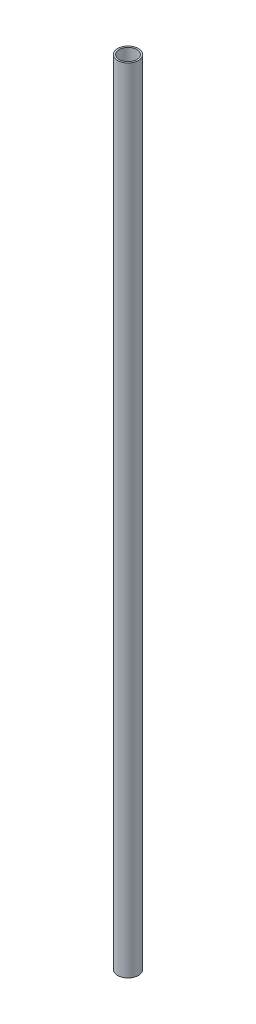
ISO-10303-21;
HEADER;
FILE_DESCRIPTION(('STEP AP214'),'2;1');
FILE_NAME('part.step','',(''),(''),'','','');
FILE_SCHEMA(('AUTOMOTIVE_DESIGN { 1 0 10303 214 1 1 1 1 }'));
ENDSEC;
DATA;
#1=APPLICATION_CONTEXT('core data for automotive mechanical design processes');
#2=APPLICATION_PROTOCOL_DEFINITION('international standard','automotive_design',2000,#1);
#3=PRODUCT_CONTEXT('',#1,'mechanical');
#4=PRODUCT('Part','Part','',(#3));
#5=PRODUCT_RELATED_PRODUCT_CATEGORY('part','',(#4));
#6=PRODUCT_DEFINITION_FORMATION('','',#4);
#7=PRODUCT_DEFINITION_CONTEXT('part definition',#1,'design');
#8=PRODUCT_DEFINITION('design','',#6,#7);
#9=PRODUCT_DEFINITION_SHAPE('','',#8);
#10=(LENGTH_UNIT() NAMED_UNIT(*) SI_UNIT(.MILLI.,.METRE.));
#11=(NAMED_UNIT(*) PLANE_ANGLE_UNIT() SI_UNIT($,.RADIAN.));
#12=(NAMED_UNIT(*) SI_UNIT($,.STERADIAN.) SOLID_ANGLE_UNIT());
#13=UNCERTAINTY_MEASURE_WITH_UNIT(LENGTH_MEASURE(1.E-05),#10,'distance_accuracy_value','');
#14=(GEOMETRIC_REPRESENTATION_CONTEXT(3) GLOBAL_UNCERTAINTY_ASSIGNED_CONTEXT((#13)) GLOBAL_UNIT_ASSIGNED_CONTEXT((#10,
#11,#12)) REPRESENTATION_CONTEXT('',''));
#15=CARTESIAN_POINT('',(0.,0.,0.));
#16=DIRECTION('',(0.,0.,1.));
#17=DIRECTION('',(1.,0.,0.));
#18=AXIS2_PLACEMENT_3D('',#15,#16,#17);
#19=CARTESIAN_POINT('',(0.,950.,0.));
#20=DIRECTION('',(0.,1.,0.));
#21=DIRECTION('',(0.,0.,1.));
#22=AXIS2_PLACEMENT_3D('',#19,#20,#21);
#23=PLANE('',#22);
#24=CARTESIAN_POINT('',(0.,950.,0.));
#25=DIRECTION('',(0.,1.,0.));
#26=DIRECTION('',(0.,0.,1.));
#27=AXIS2_PLACEMENT_3D('',#24,#25,#26);
#28=CIRCLE('',#27,12.5);
#29=CARTESIAN_POINT('',(0.,950.,-12.5));
#30=VERTEX_POINT('',#29);
#31=EDGE_CURVE('E10',#30,#30,#28,.T.);
#32=ORIENTED_EDGE('',*,*,#31,.T.);
#33=EDGE_LOOP('',(#32));
#34=FACE_BOUND('',#33,.T.);
#35=CARTESIAN_POINT('',(0.,950.,0.));
#36=DIRECTION('',(0.,1.,0.));
#37=DIRECTION('',(0.,0.,1.));
#38=AXIS2_PLACEMENT_3D('',#35,#36,#37);
#39=CIRCLE('',#38,10.5);
#40=CARTESIAN_POINT('',(0.,950.,-10.5));
#41=VERTEX_POINT('',#40);
#42=EDGE_CURVE('E51',#41,#41,#39,.T.);
#43=ORIENTED_EDGE('',*,*,#42,.F.);
#44=EDGE_LOOP('',(#43));
#45=FACE_BOUND('',#44,.T.);
#46=ADVANCED_FACE('F40',(#34,#45),#23,.T.);
#47=CARTESIAN_POINT('',(0.,0.,0.));
#48=DIRECTION('',(0.,1.,0.));
#49=DIRECTION('',(0.,0.,1.));
#50=AXIS2_PLACEMENT_3D('',#47,#48,#49);
#51=PLANE('',#50);
#52=CARTESIAN_POINT('',(0.,0.,0.));
#53=DIRECTION('',(0.,1.,0.));
#54=DIRECTION('',(0.,0.,1.));
#55=AXIS2_PLACEMENT_3D('',#52,#53,#54);
#56=CIRCLE('',#55,12.5);
#57=CARTESIAN_POINT('',(0.,-1.11022302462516E-13,-12.5));
#58=VERTEX_POINT('',#57);
#59=EDGE_CURVE('E44',#58,#58,#56,.T.);
#60=ORIENTED_EDGE('',*,*,#59,.F.);
#61=EDGE_LOOP('',(#60));
#62=FACE_BOUND('',#61,.T.);
#63=CARTESIAN_POINT('',(0.,0.,0.));
#64=DIRECTION('',(0.,1.,0.));
#65=DIRECTION('',(0.,0.,1.));
#66=AXIS2_PLACEMENT_3D('',#63,#64,#65);
#67=CIRCLE('',#66,10.5);
#68=CARTESIAN_POINT('',(0.,-1.11022302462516E-13,-10.5));
#69=VERTEX_POINT('',#68);
#70=EDGE_CURVE('E53',#69,#69,#67,.T.);
#71=ORIENTED_EDGE('',*,*,#70,.T.);
#72=EDGE_LOOP('',(#71));
#73=FACE_BOUND('',#72,.T.);
#74=ADVANCED_FACE('F63',(#62,#73),#51,.F.);
#75=CARTESIAN_POINT('',(0.,950.,0.));
#76=DIRECTION('',(0.,-1.,0.));
#77=DIRECTION('',(0.,0.,-1.));
#78=AXIS2_PLACEMENT_3D('',#75,#76,#77);
#79=CYLINDRICAL_SURFACE('',#78,12.5);
#80=CARTESIAN_POINT('',(0.,950.,-12.5));
#81=CARTESIAN_POINT('',(0.,940.104166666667,-12.5));
#82=CARTESIAN_POINT('',(0.,930.208333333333,-12.5));
#83=CARTESIAN_POINT('',(0.,910.416666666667,-12.5));
#84=CARTESIAN_POINT('',(0.,900.520833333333,-12.5));
#85=CARTESIAN_POINT('',(0.,880.729166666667,-12.5));
#86=CARTESIAN_POINT('',(0.,870.833333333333,-12.5));
#87=CARTESIAN_POINT('',(0.,851.041666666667,-12.5));
#88=CARTESIAN_POINT('',(0.,841.145833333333,-12.5));
#89=CARTESIAN_POINT('',(0.,821.354166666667,-12.5));
#90=CARTESIAN_POINT('',(0.,811.458333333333,-12.5));
#91=CARTESIAN_POINT('',(0.,791.666666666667,-12.5));
#92=CARTESIAN_POINT('',(0.,781.770833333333,-12.5));
#93=CARTESIAN_POINT('',(0.,761.979166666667,-12.5));
#94=CARTESIAN_POINT('',(0.,752.083333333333,-12.5));
#95=CARTESIAN_POINT('',(0.,732.291666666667,-12.5));
#96=CARTESIAN_POINT('',(0.,722.395833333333,-12.5));
#97=CARTESIAN_POINT('',(0.,702.604166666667,-12.5));
#98=CARTESIAN_POINT('',(0.,692.708333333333,-12.5));
#99=CARTESIAN_POINT('',(0.,672.916666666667,-12.5));
#100=CARTESIAN_POINT('',(0.,663.020833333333,-12.5));
#101=CARTESIAN_POINT('',(0.,643.229166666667,-12.5));
#102=CARTESIAN_POINT('',(0.,633.333333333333,-12.5));
#103=CARTESIAN_POINT('',(0.,613.541666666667,-12.5));
#104=CARTESIAN_POINT('',(0.,603.645833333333,-12.5));
#105=CARTESIAN_POINT('',(0.,583.854166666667,-12.5));
#106=CARTESIAN_POINT('',(0.,573.958333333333,-12.5));
#107=CARTESIAN_POINT('',(0.,554.166666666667,-12.5));
#108=CARTESIAN_POINT('',(0.,544.270833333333,-12.5));
#109=CARTESIAN_POINT('',(0.,524.479166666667,-12.5));
#110=CARTESIAN_POINT('',(0.,514.583333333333,-12.5));
#111=CARTESIAN_POINT('',(0.,494.791666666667,-12.5));
#112=CARTESIAN_POINT('',(0.,484.895833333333,-12.5));
#113=CARTESIAN_POINT('',(0.,465.104166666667,-12.5));
#114=CARTESIAN_POINT('',(0.,455.208333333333,-12.5));
#115=CARTESIAN_POINT('',(0.,435.416666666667,-12.5));
#116=CARTESIAN_POINT('',(0.,425.520833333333,-12.5));
#117=CARTESIAN_POINT('',(0.,405.729166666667,-12.5));
#118=CARTESIAN_POINT('',(0.,395.833333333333,-12.5));
#119=CARTESIAN_POINT('',(0.,376.041666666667,-12.5));
#120=CARTESIAN_POINT('',(0.,366.145833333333,-12.5));
#121=CARTESIAN_POINT('',(0.,346.354166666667,-12.5));
#122=CARTESIAN_POINT('',(0.,336.458333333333,-12.5));
#123=CARTESIAN_POINT('',(0.,316.666666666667,-12.5));
#124=CARTESIAN_POINT('',(0.,306.770833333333,-12.5));
#125=CARTESIAN_POINT('',(0.,286.979166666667,-12.5));
#126=CARTESIAN_POINT('',(0.,277.083333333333,-12.5));
#127=CARTESIAN_POINT('',(0.,257.291666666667,-12.5));
#128=CARTESIAN_POINT('',(0.,247.395833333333,-12.5));
#129=CARTESIAN_POINT('',(0.,227.604166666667,-12.5));
#130=CARTESIAN_POINT('',(0.,217.708333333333,-12.5));
#131=CARTESIAN_POINT('',(0.,197.916666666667,-12.5));
#132=CARTESIAN_POINT('',(0.,188.020833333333,-12.5));
#133=CARTESIAN_POINT('',(0.,168.229166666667,-12.5));
#134=CARTESIAN_POINT('',(0.,158.333333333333,-12.5));
#135=CARTESIAN_POINT('',(0.,138.541666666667,-12.5));
#136=CARTESIAN_POINT('',(0.,128.645833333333,-12.5));
#137=CARTESIAN_POINT('',(0.,108.854166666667,-12.5));
#138=CARTESIAN_POINT('',(0.,98.9583333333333,-12.5));
#139=CARTESIAN_POINT('',(0.,79.1666666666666,-12.5));
#140=CARTESIAN_POINT('',(0.,69.2708333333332,-12.5));
#141=CARTESIAN_POINT('',(0.,49.4791666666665,-12.5));
#142=CARTESIAN_POINT('',(0.,39.5833333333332,-12.5));
#143=CARTESIAN_POINT('',(0.,19.7916666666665,-12.5));
#144=CARTESIAN_POINT('',(0.,9.89583333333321,-12.5));
#145=CARTESIAN_POINT('',(0.,-1.11022302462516E-13,-12.5));
#146=B_SPLINE_CURVE_WITH_KNOTS('',3,(#80,#81,#82,#83,#84,#85,#86,#87,#88,#89,#90,#91,#92,#93,
#94,#95,#96,#97,#98,#99,#100,#101,#102,#103,#104,#105,#106,#107,#108,#109,#110,#111,#112,#113,
#114,#115,#116,#117,#118,#119,#120,#121,#122,#123,#124,#125,#126,#127,#128,#129,#130,#131,#132,
#133,#134,#135,#136,#137,#138,#139,#140,#141,#142,#143,#144,#145),.UNSPECIFIED.,.F.,.F.,(4,2,2,
2,2,2,2,2,2,2,2,2,2,2,2,2,2,2,2,2,2,2,2,2,2,2,2,2,2,2,2,2,4),(0.,29.6875000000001,
59.3750000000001,89.0625,118.75,148.4375,178.125,207.8125,237.5,267.1875,296.875,326.5625,
356.25,385.9375,415.625,445.3125,475.,504.6875,534.375,564.0625,593.75,623.4375,653.125,
682.8125,712.5,742.1875,771.875,801.5625,831.25,860.9375,890.625,920.3125,950.),.UNSPECIFIED.);
#147=EDGE_CURVE('BSEAM42',#30,#58,#146,.T.);
#148=ORIENTED_EDGE('',*,*,#31,.F.);
#149=ORIENTED_EDGE('',*,*,#59,.T.);
#150=ORIENTED_EDGE('',*,*,#147,.T.);
#151=ORIENTED_EDGE('',*,*,#147,.F.);
#152=EDGE_LOOP('',(#148,#150,#149,#151));
#153=FACE_BOUND('',#152,.T.);
#154=ADVANCED_FACE('F42',(#153),#79,.T.);
#155=CARTESIAN_POINT('',(0.,950.,0.));
#156=DIRECTION('',(0.,-1.,0.));
#157=DIRECTION('',(0.,0.,-1.));
#158=AXIS2_PLACEMENT_3D('',#155,#156,#157);
#159=CYLINDRICAL_SURFACE('',#158,10.5);
#160=CARTESIAN_POINT('',(0.,950.,-10.5));
#161=CARTESIAN_POINT('',(0.,940.104166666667,-10.5));
#162=CARTESIAN_POINT('',(0.,930.208333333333,-10.5));
#163=CARTESIAN_POINT('',(0.,910.416666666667,-10.5));
#164=CARTESIAN_POINT('',(0.,900.520833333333,-10.5));
#165=CARTESIAN_POINT('',(0.,880.729166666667,-10.5));
#166=CARTESIAN_POINT('',(0.,870.833333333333,-10.5));
#167=CARTESIAN_POINT('',(0.,851.041666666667,-10.5));
#168=CARTESIAN_POINT('',(0.,841.145833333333,-10.5));
#169=CARTESIAN_POINT('',(0.,821.354166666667,-10.5));
#170=CARTESIAN_POINT('',(0.,811.458333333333,-10.5));
#171=CARTESIAN_POINT('',(0.,791.666666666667,-10.5));
#172=CARTESIAN_POINT('',(0.,781.770833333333,-10.5));
#173=CARTESIAN_POINT('',(0.,761.979166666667,-10.5));
#174=CARTESIAN_POINT('',(0.,752.083333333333,-10.5));
#175=CARTESIAN_POINT('',(0.,732.291666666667,-10.5));
#176=CARTESIAN_POINT('',(0.,722.395833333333,-10.5));
#177=CARTESIAN_POINT('',(0.,702.604166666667,-10.5));
#178=CARTESIAN_POINT('',(0.,692.708333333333,-10.5));
#179=CARTESIAN_POINT('',(0.,672.916666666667,-10.5));
#180=CARTESIAN_POINT('',(0.,663.020833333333,-10.5));
#181=CARTESIAN_POINT('',(0.,643.229166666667,-10.5));
#182=CARTESIAN_POINT('',(0.,633.333333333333,-10.5));
#183=CARTESIAN_POINT('',(0.,613.541666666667,-10.5));
#184=CARTESIAN_POINT('',(0.,603.645833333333,-10.5));
#185=CARTESIAN_POINT('',(0.,583.854166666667,-10.5));
#186=CARTESIAN_POINT('',(0.,573.958333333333,-10.5));
#187=CARTESIAN_POINT('',(0.,554.166666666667,-10.5));
#188=CARTESIAN_POINT('',(0.,544.270833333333,-10.5));
#189=CARTESIAN_POINT('',(0.,524.479166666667,-10.5));
#190=CARTESIAN_POINT('',(0.,514.583333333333,-10.5));
#191=CARTESIAN_POINT('',(0.,494.791666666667,-10.5));
#192=CARTESIAN_POINT('',(0.,484.895833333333,-10.5));
#193=CARTESIAN_POINT('',(0.,465.104166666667,-10.5));
#194=CARTESIAN_POINT('',(0.,455.208333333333,-10.5));
#195=CARTESIAN_POINT('',(0.,435.416666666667,-10.5));
#196=CARTESIAN_POINT('',(0.,425.520833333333,-10.5));
#197=CARTESIAN_POINT('',(0.,405.729166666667,-10.5));
#198=CARTESIAN_POINT('',(0.,395.833333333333,-10.5));
#199=CARTESIAN_POINT('',(0.,376.041666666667,-10.5));
#200=CARTESIAN_POINT('',(0.,366.145833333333,-10.5));
#201=CARTESIAN_POINT('',(0.,346.354166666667,-10.5));
#202=CARTESIAN_POINT('',(0.,336.458333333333,-10.5));
#203=CARTESIAN_POINT('',(0.,316.666666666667,-10.5));
#204=CARTESIAN_POINT('',(0.,306.770833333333,-10.5));
#205=CARTESIAN_POINT('',(0.,286.979166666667,-10.5));
#206=CARTESIAN_POINT('',(0.,277.083333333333,-10.5));
#207=CARTESIAN_POINT('',(0.,257.291666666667,-10.5));
#208=CARTESIAN_POINT('',(0.,247.395833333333,-10.5));
#209=CARTESIAN_POINT('',(0.,227.604166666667,-10.5));
#210=CARTESIAN_POINT('',(0.,217.708333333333,-10.5));
#211=CARTESIAN_POINT('',(0.,197.916666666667,-10.5));
#212=CARTESIAN_POINT('',(0.,188.020833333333,-10.5));
#213=CARTESIAN_POINT('',(0.,168.229166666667,-10.5));
#214=CARTESIAN_POINT('',(0.,158.333333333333,-10.5));
#215=CARTESIAN_POINT('',(0.,138.541666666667,-10.5));
#216=CARTESIAN_POINT('',(0.,128.645833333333,-10.5));
#217=CARTESIAN_POINT('',(0.,108.854166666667,-10.5));
#218=CARTESIAN_POINT('',(0.,98.9583333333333,-10.5));
#219=CARTESIAN_POINT('',(0.,79.1666666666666,-10.5));
#220=CARTESIAN_POINT('',(0.,69.2708333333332,-10.5));
#221=CARTESIAN_POINT('',(0.,49.4791666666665,-10.5));
#222=CARTESIAN_POINT('',(0.,39.5833333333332,-10.5));
#223=CARTESIAN_POINT('',(0.,19.7916666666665,-10.5));
#224=CARTESIAN_POINT('',(0.,9.89583333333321,-10.5));
#225=CARTESIAN_POINT('',(0.,-1.11022302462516E-13,-10.5));
#226=B_SPLINE_CURVE_WITH_KNOTS('',3,(#160,#161,#162,#163,#164,#165,#166,#167,#168,#169,#170,
#171,#172,#173,#174,#175,#176,#177,#178,#179,#180,#181,#182,#183,#184,#185,#186,#187,#188,#189,
#190,#191,#192,#193,#194,#195,#196,#197,#198,#199,#200,#201,#202,#203,#204,#205,#206,#207,#208,
#209,#210,#211,#212,#213,#214,#215,#216,#217,#218,#219,#220,#221,#222,#223,#224,#225),
.UNSPECIFIED.,.F.,.F.,(4,2,2,2,2,2,2,2,2,2,2,2,2,2,2,2,2,2,2,2,2,2,2,2,2,2,2,2,2,2,2,2,4),(0.,
29.6875,59.375,89.0624999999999,118.75,148.4375,178.125,207.8125,237.5,267.1875,296.875,
326.5625,356.25,385.9375,415.625,445.3125,475.,504.6875,534.375,564.0625,593.75,623.4375,
653.125,682.8125,712.5,742.1875,771.875,801.5625,831.25,860.9375,890.625,920.3125,950.),.UNSPECIFIED.);
#227=EDGE_CURVE('BSEAM59',#41,#69,#226,.T.);
#228=ORIENTED_EDGE('',*,*,#42,.T.);
#229=ORIENTED_EDGE('',*,*,#70,.F.);
#230=ORIENTED_EDGE('',*,*,#227,.T.);
#231=ORIENTED_EDGE('',*,*,#227,.F.);
#232=EDGE_LOOP('',(#228,#230,#229,#231));
#233=FACE_BOUND('',#232,.T.);
#234=ADVANCED_FACE('F59',(#233),#159,.F.);
#235=CLOSED_SHELL('',(#46,#74,#154,#234));
#236=MANIFOLD_SOLID_BREP('B2',#235);
#237=ADVANCED_BREP_SHAPE_REPRESENTATION('',(#18,#236),#14);
#238=SHAPE_DEFINITION_REPRESENTATION(#9,#237);
ENDSEC;
END-ISO-10303-21;
